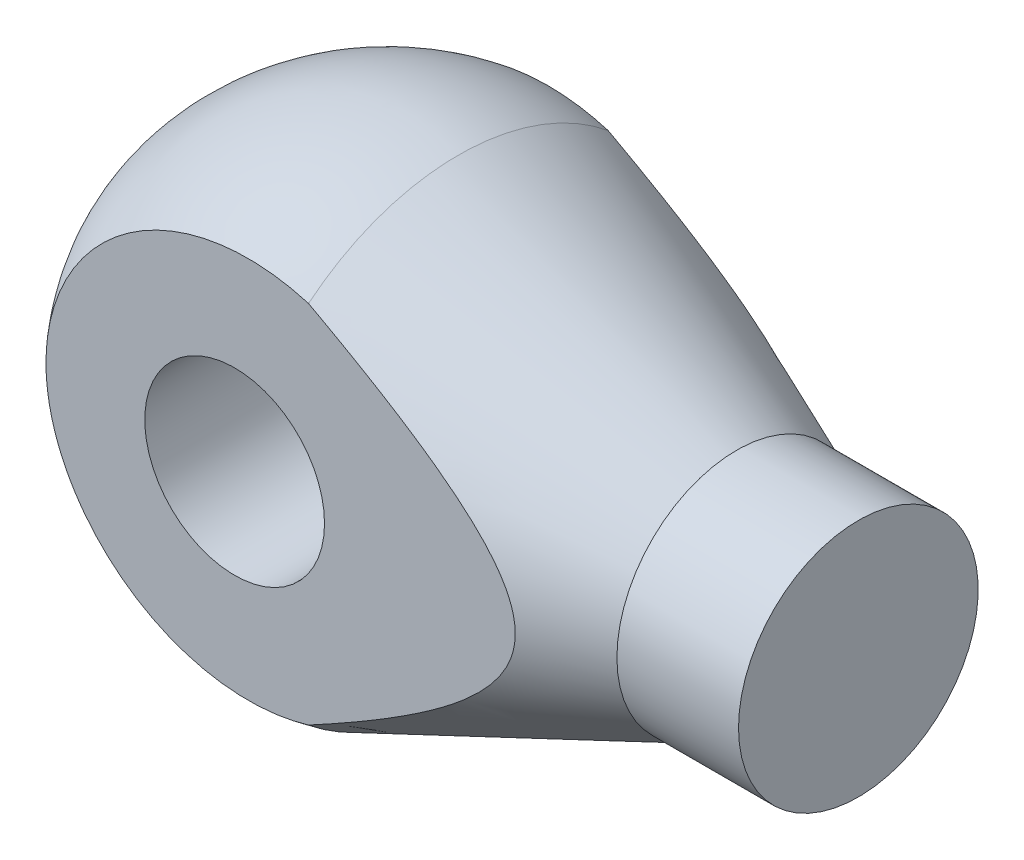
ISO-10303-21;
HEADER;
FILE_DESCRIPTION(('STEP AP214'),'2;1');
FILE_NAME('part.step','',(''),(''),'','','');
FILE_SCHEMA(('AUTOMOTIVE_DESIGN { 1 0 10303 214 1 1 1 1 }'));
ENDSEC;
DATA;
#1=APPLICATION_CONTEXT('core data for automotive mechanical design processes');
#2=APPLICATION_PROTOCOL_DEFINITION('international standard','automotive_design',2000,#1);
#3=PRODUCT_CONTEXT('',#1,'mechanical');
#4=PRODUCT('Part','Part','',(#3));
#5=PRODUCT_RELATED_PRODUCT_CATEGORY('part','',(#4));
#6=PRODUCT_DEFINITION_FORMATION('','',#4);
#7=PRODUCT_DEFINITION_CONTEXT('part definition',#1,'design');
#8=PRODUCT_DEFINITION('design','',#6,#7);
#9=PRODUCT_DEFINITION_SHAPE('','',#8);
#10=(LENGTH_UNIT() NAMED_UNIT(*) SI_UNIT(.MILLI.,.METRE.));
#11=(NAMED_UNIT(*) PLANE_ANGLE_UNIT() SI_UNIT($,.RADIAN.));
#12=(NAMED_UNIT(*) SI_UNIT($,.STERADIAN.) SOLID_ANGLE_UNIT());
#13=UNCERTAINTY_MEASURE_WITH_UNIT(LENGTH_MEASURE(1.E-05),#10,'distance_accuracy_value','');
#14=(GEOMETRIC_REPRESENTATION_CONTEXT(3) GLOBAL_UNCERTAINTY_ASSIGNED_CONTEXT((#13)) GLOBAL_UNIT_ASSIGNED_CONTEXT((#10,
#11,#12)) REPRESENTATION_CONTEXT('',''));
#15=CARTESIAN_POINT('',(0.,0.,0.));
#16=DIRECTION('',(0.,0.,1.));
#17=DIRECTION('',(1.,0.,0.));
#18=AXIS2_PLACEMENT_3D('',#15,#16,#17);
#19=CARTESIAN_POINT('',(35.9985294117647,0.,0.));
#20=DIRECTION('',(-1.,0.,0.));
#21=DIRECTION('',(0.,0.,1.));
#22=AXIS2_PLACEMENT_3D('',#19,#20,#21);
#23=CONICAL_SURFACE('',#22,20.,0.395699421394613);
#24=CARTESIAN_POINT('',(35.9985294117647,0.,0.));
#25=DIRECTION('',(-1.,0.,0.));
#26=DIRECTION('',(0.,0.,1.));
#27=AXIS2_PLACEMENT_3D('',#24,#25,#26);
#28=CIRCLE('',#27,20.);
#29=CARTESIAN_POINT('',(35.9985294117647,0.,20.));
#30=VERTEX_POINT('',#29);
#31=EDGE_CURVE('E40',#30,#30,#28,.T.);
#32=ORIENTED_EDGE('',*,*,#31,.T.);
#33=EDGE_LOOP('',(#32));
#34=FACE_BOUND('',#33,.T.);
#35=CARTESIAN_POINT('',(-49.6909462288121,-49.8810438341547,-25.));
#36=CARTESIAN_POINT('',(-48.7281549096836,-49.431164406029,-25.));
#37=CARTESIAN_POINT('',(-47.7658298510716,-48.9802872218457,-25.));
#38=CARTESIAN_POINT('',(-45.8421994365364,-48.0763615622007,-25.));
#39=CARTESIAN_POINT('',(-44.8808940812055,-47.6233130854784,-25.));
#40=CARTESIAN_POINT('',(-41.9985943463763,-46.2606262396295,-25.));
#41=CARTESIAN_POINT('',(-40.079262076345,-45.3474678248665,-25.));
#42=CARTESIAN_POINT('',(-36.2430812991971,-43.5086917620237,-25.));
#43=CARTESIAN_POINT('',(-34.3262406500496,-42.5830577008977,-25.));
#44=CARTESIAN_POINT('',(-31.4558738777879,-41.184594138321,-25.));
#45=CARTESIAN_POINT('',(-30.4999067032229,-40.7167738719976,-25.));
#46=CARTESIAN_POINT('',(-28.5897788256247,-39.7774416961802,-25.));
#47=CARTESIAN_POINT('',(-27.6356181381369,-39.3059297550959,-25.));
#48=CARTESIAN_POINT('',(-24.6736756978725,-37.8344077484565,-25.));
#49=CARTESIAN_POINT('',(-22.6693437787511,-36.8274235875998,-25.));
#50=CARTESIAN_POINT('',(-19.6714525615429,-35.300086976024,-25.));
#51=CARTESIAN_POINT('',(-18.673593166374,-34.7881664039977,-25.));
#52=CARTESIAN_POINT('',(-16.6811626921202,-33.7579685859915,-25.));
#53=CARTESIAN_POINT('',(-15.6865916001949,-33.2396913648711,-25.));
#54=CARTESIAN_POINT('',(-13.7021572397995,-32.1964264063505,-25.));
#55=CARTESIAN_POINT('',(-12.7122904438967,-31.6714453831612,-25.));
#56=CARTESIAN_POINT('',(-10.7369400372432,-30.6132875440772,-25.));
#57=CARTESIAN_POINT('',(-9.75145643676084,-30.0801107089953,-25.));
#58=CARTESIAN_POINT('',(-7.78568955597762,-29.0043742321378,-25.));
#59=CARTESIAN_POINT('',(-6.80540598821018,-28.4618151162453,-25.));
#60=CARTESIAN_POINT('',(-4.85095508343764,-27.3658030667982,-25.));
#61=CARTESIAN_POINT('',(-3.8767876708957,-26.8123502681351,-25.));
#62=CARTESIAN_POINT('',(-1.94827387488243,-25.6999021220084,-25.));
#63=CARTESIAN_POINT('',(-0.993833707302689,-25.1410696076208,-25.));
#64=CARTESIAN_POINT('',(0.906369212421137,-24.0087522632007,-25.));
#65=CARTESIAN_POINT('',(1.85213173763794,-23.4352670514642,-25.));
#66=CARTESIAN_POINT('',(3.73451979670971,-22.2698154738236,-25.));
#67=CARTESIAN_POINT('',(4.67112637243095,-21.677818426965,-25.));
#68=CARTESIAN_POINT('',(6.53061418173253,-20.4726842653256,-25.));
#69=CARTESIAN_POINT('',(7.45349645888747,-19.8595487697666,-25.));
#70=CARTESIAN_POINT('',(8.81769586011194,-18.9249484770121,-25.));
#71=CARTESIAN_POINT('',(9.26577096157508,-18.613335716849,-25.));
#72=CARTESIAN_POINT('',(10.1569241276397,-17.9830526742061,-25.));
#73=CARTESIAN_POINT('',(10.6000023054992,-17.6643825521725,-25.));
#74=CARTESIAN_POINT('',(11.4805491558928,-17.0190225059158,-25.));
#75=CARTESIAN_POINT('',(11.9180156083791,-16.6923295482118,-25.));
#76=CARTESIAN_POINT('',(12.786177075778,-16.0300618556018,-25.));
#77=CARTESIAN_POINT('',(13.2168721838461,-15.6944872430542,-25.));
#78=CARTESIAN_POINT('',(14.0690517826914,-15.0142705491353,-25.));
#79=CARTESIAN_POINT('',(14.4905590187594,-14.6696570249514,-25.));
#80=CARTESIAN_POINT('',(15.324108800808,-13.969080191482,-25.));
#81=CARTESIAN_POINT('',(15.7361507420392,-13.6131161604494,-25.));
#82=CARTESIAN_POINT('',(16.5484481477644,-12.8885519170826,-25.));
#83=CARTESIAN_POINT('',(16.9487121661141,-12.5199613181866,-25.));
#84=CARTESIAN_POINT('',(17.7351489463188,-11.7680958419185,-25.));
#85=CARTESIAN_POINT('',(18.1213245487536,-11.3848239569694,-25.));
#86=CARTESIAN_POINT('',(18.650085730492,-10.8360799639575,-25.));
#87=CARTESIAN_POINT('',(18.8000209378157,-10.6776647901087,-25.));
#88=CARTESIAN_POINT('',(19.0968037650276,-10.3579672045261,-25.));
#89=CARTESIAN_POINT('',(19.2436513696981,-10.1966847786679,-25.));
#90=CARTESIAN_POINT('',(19.6791646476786,-9.70825956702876,-25.));
#91=CARTESIAN_POINT('',(19.9627738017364,-9.37656668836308,-25.));
#92=CARTESIAN_POINT('',(20.5142131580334,-8.69903445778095,-25.));
#93=CARTESIAN_POINT('',(20.7820069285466,-8.35316533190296,-25.));
#94=CARTESIAN_POINT('',(21.2974743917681,-7.64664538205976,-25.));
#95=CARTESIAN_POINT('',(21.5451479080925,-7.2859944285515,-25.));
#96=CARTESIAN_POINT('',(22.0194457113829,-6.54303002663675,-25.));
#97=CARTESIAN_POINT('',(22.2456814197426,-6.16046643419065,-25.));
#98=CARTESIAN_POINT('',(22.666760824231,-5.37820547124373,-25.));
#99=CARTESIAN_POINT('',(22.8616012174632,-4.97850630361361,-25.));
#100=CARTESIAN_POINT('',(23.2122587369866,-4.16397334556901,-25.));
#101=CARTESIAN_POINT('',(23.3682224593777,-3.74920338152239,-25.));
#102=CARTESIAN_POINT('',(23.634685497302,-2.90532138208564,-25.));
#103=CARTESIAN_POINT('',(23.7452162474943,-2.47621948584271,-25.));
#104=CARTESIAN_POINT('',(23.8878639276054,-1.74441927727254,-25.));
#105=CARTESIAN_POINT('',(23.9337062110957,-1.44435874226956,-25.));
#106=CARTESIAN_POINT('',(23.9996108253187,-0.841420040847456,-25.));
#107=CARTESIAN_POINT('',(24.0196775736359,-0.538542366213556,-25.));
#108=CARTESIAN_POINT('',(24.0333449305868,0.0678307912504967,-25.));
#109=CARTESIAN_POINT('',(24.0269435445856,0.3713263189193,-25.));
#110=CARTESIAN_POINT('',(23.9878946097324,0.976628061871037,-25.));
#111=CARTESIAN_POINT('',(23.9552455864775,1.27843418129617,-25.));
#112=CARTESIAN_POINT('',(23.8649783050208,1.87691470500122,-25.));
#113=CARTESIAN_POINT('',(23.8074690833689,2.17360570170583,-25.));
#114=CARTESIAN_POINT('',(23.6692274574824,2.76153745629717,-25.));
#115=CARTESIAN_POINT('',(23.5884909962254,3.05277725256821,-25.));
#116=CARTESIAN_POINT('',(23.4059280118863,3.62857366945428,-25.));
#117=CARTESIAN_POINT('',(23.3040984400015,3.91312931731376,-25.));
#118=CARTESIAN_POINT('',(23.0816596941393,4.47477110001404,-25.));
#119=CARTESIAN_POINT('',(22.9610484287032,4.75185639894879,-25.));
#120=CARTESIAN_POINT('',(22.6045132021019,5.50765345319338,-25.));
#121=CARTESIAN_POINT('',(22.3510582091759,5.97813623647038,-25.));
#122=CARTESIAN_POINT('',(21.8038178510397,6.89504860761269,-25.));
#123=CARTESIAN_POINT('',(21.5100004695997,7.34145870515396,-25.));
#124=CARTESIAN_POINT('',(20.8898080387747,8.21367940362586,-25.));
#125=CARTESIAN_POINT('',(20.5633040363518,8.63939771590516,-25.));
#126=CARTESIAN_POINT('',(20.0551758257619,9.26267566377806,-25.));
#127=CARTESIAN_POINT('',(19.8827598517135,9.46786098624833,-25.));
#128=CARTESIAN_POINT('',(19.5324332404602,9.87349708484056,-25.));
#129=CARTESIAN_POINT('',(19.3545225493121,10.0739478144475,-25.));
#130=CARTESIAN_POINT('',(18.8869402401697,10.5878889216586,-25.));
#131=CARTESIAN_POINT('',(18.5935194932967,10.8979700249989,-25.));
#132=CARTESIAN_POINT('',(17.9963129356,11.50801989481,-25.));
#133=CARTESIAN_POINT('',(17.6925257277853,11.8079872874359,-25.));
#134=CARTESIAN_POINT('',(17.0760784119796,12.3989419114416,-25.));
#135=CARTESIAN_POINT('',(16.7634141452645,12.6899247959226,-25.));
#136=CARTESIAN_POINT('',(16.130629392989,13.2636814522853,-25.));
#137=CARTESIAN_POINT('',(15.8105084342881,13.5464547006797,-25.));
#138=CARTESIAN_POINT('',(14.8392305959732,14.3848727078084,-25.));
#139=CARTESIAN_POINT('',(14.178453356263,14.9293906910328,-25.));
#140=CARTESIAN_POINT('',(12.8379091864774,15.9939851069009,-25.));
#141=CARTESIAN_POINT('',(12.1581466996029,16.5140671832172,-25.));
#142=CARTESIAN_POINT('',(10.7759308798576,17.5399018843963,-25.));
#143=CARTESIAN_POINT('',(10.0733075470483,18.0454247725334,-25.));
#144=CARTESIAN_POINT('',(8.6559921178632,19.0392712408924,-25.));
#145=CARTESIAN_POINT('',(7.94129940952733,19.5275939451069,-25.));
#146=CARTESIAN_POINT('',(6.50321988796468,20.488982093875,-25.));
#147=CARTESIAN_POINT('',(5.77984695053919,20.9620683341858,-25.));
#148=CARTESIAN_POINT('',(4.6888359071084,21.6623590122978,-25.));
#149=CARTESIAN_POINT('',(4.32417968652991,21.8942290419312,-25.));
#150=CARTESIAN_POINT('',(3.59304561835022,22.3550786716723,-25.));
#151=CARTESIAN_POINT('',(3.22656777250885,22.5840582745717,-25.));
#152=CARTESIAN_POINT('',(1.9395909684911,23.3816668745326,-25.));
#153=CARTESIAN_POINT('',(1.01471390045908,23.9432425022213,-25.));
#154=CARTESIAN_POINT('',(-0.843469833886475,25.0522928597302,-25.));
#155=CARTESIAN_POINT('',(-1.77677678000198,25.5997671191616,-25.));
#156=CARTESIAN_POINT('',(-3.65044306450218,26.6827683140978,-25.));
#157=CARTESIAN_POINT('',(-4.59080326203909,27.2182937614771,-25.));
#158=CARTESIAN_POINT('',(-6.47731362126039,28.2790134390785,-25.));
#159=CARTESIAN_POINT('',(-7.42346373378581,28.8042077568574,-25.));
#160=CARTESIAN_POINT('',(-9.32108170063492,29.8458688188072,-25.));
#161=CARTESIAN_POINT('',(-10.272551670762,30.3623317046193,-25.));
#162=CARTESIAN_POINT('',(-12.1797014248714,31.3874336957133,-25.));
#163=CARTESIAN_POINT('',(-13.1353812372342,31.896072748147,-25.));
#164=CARTESIAN_POINT('',(-15.0503881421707,32.9064740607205,-25.));
#165=CARTESIAN_POINT('',(-16.0097152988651,33.4082361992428,-25.));
#166=CARTESIAN_POINT('',(-17.9315331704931,34.4056660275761,-25.));
#167=CARTESIAN_POINT('',(-18.8940238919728,34.9013337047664,-25.));
#168=CARTESIAN_POINT('',(-20.8240993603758,35.8884296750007,-25.));
#169=CARTESIAN_POINT('',(-21.7916907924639,36.3798448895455,-25.));
#170=CARTESIAN_POINT('',(-23.7293195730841,37.3577906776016,-25.));
#171=CARTESIAN_POINT('',(-24.6993568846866,37.8443213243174,-25.));
#172=CARTESIAN_POINT('',(-26.6416335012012,38.8130087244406,-25.));
#173=CARTESIAN_POINT('',(-27.6138728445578,39.2951654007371,-25.));
#174=CARTESIAN_POINT('',(-29.5603072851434,40.255522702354,-25.));
#175=CARTESIAN_POINT('',(-30.5345023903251,40.7337233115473,-25.));
#176=CARTESIAN_POINT('',(-33.4591724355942,42.1626972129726,-25.));
#177=CARTESIAN_POINT('',(-35.4122680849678,43.1081093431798,-25.));
#178=CARTESIAN_POINT('',(-39.3241350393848,44.9870768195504,-25.));
#179=CARTESIAN_POINT('',(-41.2829063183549,45.9206322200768,-25.));
#180=CARTESIAN_POINT('',(-44.9916959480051,47.6766990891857,-25.));
#181=CARTESIAN_POINT('',(-46.7412288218,48.5002365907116,-25.));
#182=CARTESIAN_POINT('',(-50.2434988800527,50.1404685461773,-25.));
#183=CARTESIAN_POINT('',(-51.9962360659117,50.9571629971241,-25.));
#184=CARTESIAN_POINT('',(-55.5046130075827,52.5846586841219,-25.));
#185=CARTESIAN_POINT('',(-57.260252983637,53.395459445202,-25.));
#186=CARTESIAN_POINT('',(-60.7739361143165,55.0118373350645,-25.));
#187=CARTESIAN_POINT('',(-62.5319792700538,55.8174144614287,-25.));
#188=CARTESIAN_POINT('',(-66.0426807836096,57.4205421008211,-25.));
#189=CARTESIAN_POINT('',(-67.7953302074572,58.2181121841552,-25.));
#190=CARTESIAN_POINT('',(-71.3024685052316,59.809198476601,-25.));
#191=CARTESIAN_POINT('',(-73.0569573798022,60.6027146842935,-25.));
#192=CARTESIAN_POINT('',(-76.5673892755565,62.186055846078,-25.));
#193=CARTESIAN_POINT('',(-78.3233321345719,62.9758811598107,-25.));
#194=CARTESIAN_POINT('',(-81.8366720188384,64.5522845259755,-25.));
#195=CARTESIAN_POINT('',(-83.5940690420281,65.3388625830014,-25.));
#196=CARTESIAN_POINT('',(-85.3521084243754,66.1240003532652,-25.));
#197=B_SPLINE_CURVE_WITH_KNOTS('',3,(#35,#36,#37,#38,#39,#40,#41,#42,#43,#44,#45,#46,#47,#48,
#49,#50,#51,#52,#53,#54,#55,#56,#57,#58,#59,#60,#61,#62,#63,#64,#65,#66,#67,#68,#69,#70,#71,#72,
#73,#74,#75,#76,#77,#78,#79,#80,#81,#82,#83,#84,#85,#86,#87,#88,#89,#90,#91,#92,#93,#94,#95,#96,
#97,#98,#99,#100,#101,#102,#103,#104,#105,#106,#107,#108,#109,#110,#111,#112,#113,#114,#115,
#116,#117,#118,#119,#120,#121,#122,#123,#124,#125,#126,#127,#128,#129,#130,#131,#132,#133,#134,
#135,#136,#137,#138,#139,#140,#141,#142,#143,#144,#145,#146,#147,#148,#149,#150,#151,#152,#153,
#154,#155,#156,#157,#158,#159,#160,#161,#162,#163,#164,#165,#166,#167,#168,#169,#170,#171,#172,
#173,#174,#175,#176,#177,#178,#179,#180,#181,#182,#183,#184,#185,#186,#187,#188,#189,#190,#191,
#192,#193,#194,#195,#196),.UNSPECIFIED.,.F.,.F.,(4,2,2,2,2,2,2,2,2,2,2,2,2,2,2,2,2,2,2,2,2,2,2,
2,2,2,2,2,2,2,2,2,2,2,2,2,2,2,2,2,2,2,2,2,2,2,2,2,2,2,2,2,2,2,2,2,2,2,2,2,2,2,2,2,2,2,2,2,2,2,2,
2,2,2,2,2,2,2,2,2,4),(0.,3.18813768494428,6.37627722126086,12.7527078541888,19.1385583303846,
22.3314430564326,25.5243551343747,32.2534276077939,35.6179419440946,38.9824431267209,
42.3438042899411,45.7051733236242,49.0663545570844,52.4274941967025,55.7454051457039,
59.0634026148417,62.3872257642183,65.7107948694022,67.3480745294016,68.9853170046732,
70.6231883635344,72.2610371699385,73.8942197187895,75.5275063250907,77.1595758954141,
78.7913145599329,79.4456372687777,80.099963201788,81.4087312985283,82.7204052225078,
84.0320906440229,85.3642354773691,86.6965203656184,88.0237027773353,89.349965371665,
90.2595890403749,91.1690567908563,92.0785930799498,92.9881804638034,93.8938182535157,
94.799614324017,95.7055414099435,96.6115694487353,98.2119943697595,99.8136961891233,
101.421986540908,102.225935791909,103.029892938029,104.31029660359,105.590873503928,
106.872060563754,108.153329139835,110.721207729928,113.288490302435,115.88492127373,
118.481484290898,121.074338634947,122.370723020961,123.667106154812,126.912991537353,
130.158985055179,133.405380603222,136.651748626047,139.89951555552,143.147304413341,
146.395150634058,149.643003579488,152.898675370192,156.154298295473,159.409978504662,
162.665671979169,169.175262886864,175.684823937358,181.485816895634,187.286812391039,
193.08827031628,198.889730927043,204.666496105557,210.443263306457,216.219455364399,
221.995639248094),.UNSPECIFIED.);
#198=CARTESIAN_POINT('',(-10.4660426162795,30.4652489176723,-25.));
#199=VERTEX_POINT('',#198);
#200=CARTESIAN_POINT('',(-10.4660426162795,-30.4652489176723,-25.));
#201=VERTEX_POINT('',#200);
#202=EDGE_CURVE('E47',#199,#201,#197,.F.);
#203=ORIENTED_EDGE('',*,*,#202,.F.);
#204=CARTESIAN_POINT('',(-10.4660426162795,0.,0.));
#205=DIRECTION('',(-1.,0.,0.));
#206=DIRECTION('',(0.,0.,1.));
#207=AXIS2_PLACEMENT_3D('',#204,#205,#206);
#208=CIRCLE('',#207,39.409788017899);
#209=CARTESIAN_POINT('',(-10.4660426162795,30.4652489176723,25.));
#210=VERTEX_POINT('',#209);
#211=EDGE_CURVE('E71',#210,#199,#208,.T.);
#212=ORIENTED_EDGE('',*,*,#211,.F.);
#213=CARTESIAN_POINT('',(-49.690946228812,-49.8810438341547,25.));
#214=CARTESIAN_POINT('',(-48.7281549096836,-49.431164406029,25.));
#215=CARTESIAN_POINT('',(-47.7658298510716,-48.9802872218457,25.));
#216=CARTESIAN_POINT('',(-45.8421994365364,-48.0763615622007,25.));
#217=CARTESIAN_POINT('',(-44.8808940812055,-47.6233130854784,25.));
#218=CARTESIAN_POINT('',(-41.9985943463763,-46.2606262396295,25.));
#219=CARTESIAN_POINT('',(-40.079262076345,-45.3474678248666,25.));
#220=CARTESIAN_POINT('',(-36.2430812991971,-43.5086917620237,25.));
#221=CARTESIAN_POINT('',(-34.3262406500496,-42.5830577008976,25.));
#222=CARTESIAN_POINT('',(-31.4558738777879,-41.184594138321,25.));
#223=CARTESIAN_POINT('',(-30.4999067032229,-40.7167738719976,25.));
#224=CARTESIAN_POINT('',(-28.5897788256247,-39.7774416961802,25.));
#225=CARTESIAN_POINT('',(-27.6356181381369,-39.3059297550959,25.));
#226=CARTESIAN_POINT('',(-24.6736756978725,-37.8344077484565,25.));
#227=CARTESIAN_POINT('',(-22.6693437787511,-36.8274235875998,25.));
#228=CARTESIAN_POINT('',(-19.6714525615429,-35.300086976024,25.));
#229=CARTESIAN_POINT('',(-18.673593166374,-34.7881664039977,25.));
#230=CARTESIAN_POINT('',(-16.6811626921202,-33.7579685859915,25.));
#231=CARTESIAN_POINT('',(-15.6865916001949,-33.2396913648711,25.));
#232=CARTESIAN_POINT('',(-13.7021572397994,-32.1964264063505,25.));
#233=CARTESIAN_POINT('',(-12.7122904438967,-31.6714453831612,25.));
#234=CARTESIAN_POINT('',(-10.7369400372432,-30.6132875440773,25.));
#235=CARTESIAN_POINT('',(-9.75145643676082,-30.0801107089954,25.));
#236=CARTESIAN_POINT('',(-7.7856895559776,-29.0043742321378,25.));
#237=CARTESIAN_POINT('',(-6.80540598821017,-28.4618151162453,25.));
#238=CARTESIAN_POINT('',(-4.85095508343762,-27.3658030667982,25.));
#239=CARTESIAN_POINT('',(-3.87678767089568,-26.8123502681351,25.));
#240=CARTESIAN_POINT('',(-1.94827387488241,-25.6999021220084,25.));
#241=CARTESIAN_POINT('',(-0.993833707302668,-25.1410696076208,25.));
#242=CARTESIAN_POINT('',(0.906369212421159,-24.0087522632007,25.));
#243=CARTESIAN_POINT('',(1.85213173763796,-23.4352670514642,25.));
#244=CARTESIAN_POINT('',(3.73451979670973,-22.2698154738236,25.));
#245=CARTESIAN_POINT('',(4.67112637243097,-21.677818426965,25.));
#246=CARTESIAN_POINT('',(6.53061418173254,-20.4726842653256,25.));
#247=CARTESIAN_POINT('',(7.45349645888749,-19.8595487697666,25.));
#248=CARTESIAN_POINT('',(8.81769586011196,-18.9249484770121,25.));
#249=CARTESIAN_POINT('',(9.26577096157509,-18.613335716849,25.));
#250=CARTESIAN_POINT('',(10.1569241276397,-17.9830526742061,25.));
#251=CARTESIAN_POINT('',(10.6000023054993,-17.6643825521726,25.));
#252=CARTESIAN_POINT('',(11.4805491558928,-17.0190225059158,25.));
#253=CARTESIAN_POINT('',(11.9180156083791,-16.6923295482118,25.));
#254=CARTESIAN_POINT('',(12.786177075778,-16.0300618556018,25.));
#255=CARTESIAN_POINT('',(13.2168721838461,-15.6944872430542,25.));
#256=CARTESIAN_POINT('',(14.0690517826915,-15.0142705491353,25.));
#257=CARTESIAN_POINT('',(14.4905590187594,-14.6696570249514,25.));
#258=CARTESIAN_POINT('',(15.324108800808,-13.969080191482,25.));
#259=CARTESIAN_POINT('',(15.7361507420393,-13.6131161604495,25.));
#260=CARTESIAN_POINT('',(16.5484481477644,-12.8885519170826,25.));
#261=CARTESIAN_POINT('',(16.9487121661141,-12.5199613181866,25.));
#262=CARTESIAN_POINT('',(17.7351489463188,-11.7680958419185,25.));
#263=CARTESIAN_POINT('',(18.1213245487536,-11.3848239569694,25.));
#264=CARTESIAN_POINT('',(18.650085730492,-10.8360799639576,25.));
#265=CARTESIAN_POINT('',(18.8000209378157,-10.6776647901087,25.));
#266=CARTESIAN_POINT('',(19.0968037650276,-10.3579672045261,25.));
#267=CARTESIAN_POINT('',(19.2436513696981,-10.1966847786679,25.));
#268=CARTESIAN_POINT('',(19.6791646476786,-9.70825956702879,25.));
#269=CARTESIAN_POINT('',(19.9627738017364,-9.37656668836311,25.));
#270=CARTESIAN_POINT('',(20.5142131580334,-8.69903445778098,25.));
#271=CARTESIAN_POINT('',(20.7820069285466,-8.35316533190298,25.));
#272=CARTESIAN_POINT('',(21.2974743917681,-7.64664538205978,25.));
#273=CARTESIAN_POINT('',(21.5451479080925,-7.28599442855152,25.));
#274=CARTESIAN_POINT('',(22.0194457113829,-6.54303002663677,25.));
#275=CARTESIAN_POINT('',(22.2456814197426,-6.16046643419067,25.));
#276=CARTESIAN_POINT('',(22.666760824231,-5.37820547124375,25.));
#277=CARTESIAN_POINT('',(22.8616012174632,-4.97850630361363,25.));
#278=CARTESIAN_POINT('',(23.2122587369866,-4.16397334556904,25.));
#279=CARTESIAN_POINT('',(23.3682224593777,-3.74920338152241,25.));
#280=CARTESIAN_POINT('',(23.634685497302,-2.90532138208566,25.));
#281=CARTESIAN_POINT('',(23.7452162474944,-2.47621948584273,25.));
#282=CARTESIAN_POINT('',(23.8878639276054,-1.74441927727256,25.));
#283=CARTESIAN_POINT('',(23.9337062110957,-1.44435874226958,25.));
#284=CARTESIAN_POINT('',(23.9996108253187,-0.84142004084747,25.));
#285=CARTESIAN_POINT('',(24.019677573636,-0.538542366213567,25.));
#286=CARTESIAN_POINT('',(24.0333449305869,0.0678307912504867,25.));
#287=CARTESIAN_POINT('',(24.0269435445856,0.371326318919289,25.));
#288=CARTESIAN_POINT('',(23.9878946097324,0.976628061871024,25.));
#289=CARTESIAN_POINT('',(23.9552455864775,1.27843418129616,25.));
#290=CARTESIAN_POINT('',(23.8649783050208,1.8769147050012,25.));
#291=CARTESIAN_POINT('',(23.8074690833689,2.17360570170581,25.));
#292=CARTESIAN_POINT('',(23.6692274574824,2.76153745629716,25.));
#293=CARTESIAN_POINT('',(23.5884909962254,3.0527772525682,25.));
#294=CARTESIAN_POINT('',(23.4059280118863,3.62857366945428,25.));
#295=CARTESIAN_POINT('',(23.3040984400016,3.91312931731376,25.));
#296=CARTESIAN_POINT('',(23.0816596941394,4.47477110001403,25.));
#297=CARTESIAN_POINT('',(22.9610484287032,4.75185639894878,25.));
#298=CARTESIAN_POINT('',(22.6045132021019,5.50765345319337,25.));
#299=CARTESIAN_POINT('',(22.3510582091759,5.97813623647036,25.));
#300=CARTESIAN_POINT('',(21.8038178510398,6.89504860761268,25.));
#301=CARTESIAN_POINT('',(21.5100004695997,7.34145870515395,25.));
#302=CARTESIAN_POINT('',(20.8898080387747,8.21367940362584,25.));
#303=CARTESIAN_POINT('',(20.5633040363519,8.63939771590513,25.));
#304=CARTESIAN_POINT('',(20.0551758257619,9.26267566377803,25.));
#305=CARTESIAN_POINT('',(19.8827598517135,9.46786098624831,25.));
#306=CARTESIAN_POINT('',(19.5324332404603,9.87349708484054,25.));
#307=CARTESIAN_POINT('',(19.3545225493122,10.0739478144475,25.));
#308=CARTESIAN_POINT('',(18.8869402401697,10.5878889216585,25.));
#309=CARTESIAN_POINT('',(18.5935194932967,10.8979700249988,25.));
#310=CARTESIAN_POINT('',(17.9963129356,11.50801989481,25.));
#311=CARTESIAN_POINT('',(17.6925257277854,11.8079872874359,25.));
#312=CARTESIAN_POINT('',(17.0760784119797,12.3989419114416,25.));
#313=CARTESIAN_POINT('',(16.7634141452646,12.6899247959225,25.));
#314=CARTESIAN_POINT('',(16.130629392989,13.2636814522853,25.));
#315=CARTESIAN_POINT('',(15.8105084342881,13.5464547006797,25.));
#316=CARTESIAN_POINT('',(14.8392305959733,14.3848727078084,25.));
#317=CARTESIAN_POINT('',(14.178453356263,14.9293906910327,25.));
#318=CARTESIAN_POINT('',(12.8379091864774,15.9939851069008,25.));
#319=CARTESIAN_POINT('',(12.158146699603,16.5140671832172,25.));
#320=CARTESIAN_POINT('',(10.7759308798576,17.5399018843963,25.));
#321=CARTESIAN_POINT('',(10.0733075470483,18.0454247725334,25.));
#322=CARTESIAN_POINT('',(8.65599211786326,19.0392712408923,25.));
#323=CARTESIAN_POINT('',(7.94129940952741,19.5275939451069,25.));
#324=CARTESIAN_POINT('',(6.50321988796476,20.488982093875,25.));
#325=CARTESIAN_POINT('',(5.77984695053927,20.9620683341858,25.));
#326=CARTESIAN_POINT('',(4.68883590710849,21.6623590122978,25.));
#327=CARTESIAN_POINT('',(4.32417968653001,21.8942290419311,25.));
#328=CARTESIAN_POINT('',(3.59304561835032,22.3550786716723,25.));
#329=CARTESIAN_POINT('',(3.22656777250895,22.5840582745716,25.));
#330=CARTESIAN_POINT('',(1.9395909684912,23.3816668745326,25.));
#331=CARTESIAN_POINT('',(1.01471390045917,23.9432425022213,25.));
#332=CARTESIAN_POINT('',(-0.843469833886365,25.0522928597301,25.));
#333=CARTESIAN_POINT('',(-1.77677678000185,25.5997671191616,25.));
#334=CARTESIAN_POINT('',(-3.65044306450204,26.6827683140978,25.));
#335=CARTESIAN_POINT('',(-4.59080326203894,27.218293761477,25.));
#336=CARTESIAN_POINT('',(-6.47731362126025,28.2790134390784,25.));
#337=CARTESIAN_POINT('',(-7.42346373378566,28.8042077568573,25.));
#338=CARTESIAN_POINT('',(-9.32108170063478,29.8458688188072,25.));
#339=CARTESIAN_POINT('',(-10.2725516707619,30.3623317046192,25.));
#340=CARTESIAN_POINT('',(-12.1797014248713,31.3874336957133,25.));
#341=CARTESIAN_POINT('',(-13.1353812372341,31.896072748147,25.));
#342=CARTESIAN_POINT('',(-15.0503881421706,32.9064740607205,25.));
#343=CARTESIAN_POINT('',(-16.009715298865,33.4082361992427,25.));
#344=CARTESIAN_POINT('',(-17.9315331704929,34.4056660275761,25.));
#345=CARTESIAN_POINT('',(-18.8940238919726,34.9013337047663,25.));
#346=CARTESIAN_POINT('',(-20.8240993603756,35.8884296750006,25.));
#347=CARTESIAN_POINT('',(-21.7916907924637,36.3798448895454,25.));
#348=CARTESIAN_POINT('',(-23.7293195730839,37.3577906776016,25.));
#349=CARTESIAN_POINT('',(-24.6993568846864,37.8443213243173,25.));
#350=CARTESIAN_POINT('',(-26.641633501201,38.8130087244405,25.));
#351=CARTESIAN_POINT('',(-27.6138728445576,39.295165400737,25.));
#352=CARTESIAN_POINT('',(-29.5603072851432,40.2555227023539,25.));
#353=CARTESIAN_POINT('',(-30.5345023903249,40.7337233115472,25.));
#354=CARTESIAN_POINT('',(-33.459172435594,42.1626972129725,25.));
#355=CARTESIAN_POINT('',(-35.4122680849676,43.1081093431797,25.));
#356=CARTESIAN_POINT('',(-39.3241350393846,44.9870768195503,25.));
#357=CARTESIAN_POINT('',(-41.2829063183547,45.9206322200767,25.));
#358=CARTESIAN_POINT('',(-44.9916959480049,47.6766990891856,25.));
#359=CARTESIAN_POINT('',(-46.7412288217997,48.5002365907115,25.));
#360=CARTESIAN_POINT('',(-50.2434988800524,50.1404685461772,25.));
#361=CARTESIAN_POINT('',(-51.9962360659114,50.957162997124,25.));
#362=CARTESIAN_POINT('',(-55.5046130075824,52.5846586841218,25.));
#363=CARTESIAN_POINT('',(-57.2602529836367,53.3954594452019,25.));
#364=CARTESIAN_POINT('',(-60.7739361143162,55.0118373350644,25.));
#365=CARTESIAN_POINT('',(-62.5319792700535,55.8174144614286,25.));
#366=CARTESIAN_POINT('',(-66.0426807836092,57.420542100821,25.));
#367=CARTESIAN_POINT('',(-67.7953302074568,58.218112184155,25.));
#368=CARTESIAN_POINT('',(-71.3024685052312,59.8091984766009,25.));
#369=CARTESIAN_POINT('',(-73.0569573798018,60.6027146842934,25.));
#370=CARTESIAN_POINT('',(-76.567389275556,62.1860558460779,25.));
#371=CARTESIAN_POINT('',(-78.3233321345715,62.9758811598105,25.));
#372=CARTESIAN_POINT('',(-81.836672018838,64.5522845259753,25.));
#373=CARTESIAN_POINT('',(-83.5940690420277,65.3388625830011,25.));
#374=CARTESIAN_POINT('',(-85.352108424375,66.124000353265,25.));
#375=B_SPLINE_CURVE_WITH_KNOTS('',3,(#213,#214,#215,#216,#217,#218,#219,#220,#221,#222,#223,
#224,#225,#226,#227,#228,#229,#230,#231,#232,#233,#234,#235,#236,#237,#238,#239,#240,#241,#242,
#243,#244,#245,#246,#247,#248,#249,#250,#251,#252,#253,#254,#255,#256,#257,#258,#259,#260,#261,
#262,#263,#264,#265,#266,#267,#268,#269,#270,#271,#272,#273,#274,#275,#276,#277,#278,#279,#280,
#281,#282,#283,#284,#285,#286,#287,#288,#289,#290,#291,#292,#293,#294,#295,#296,#297,#298,#299,
#300,#301,#302,#303,#304,#305,#306,#307,#308,#309,#310,#311,#312,#313,#314,#315,#316,#317,#318,
#319,#320,#321,#322,#323,#324,#325,#326,#327,#328,#329,#330,#331,#332,#333,#334,#335,#336,#337,
#338,#339,#340,#341,#342,#343,#344,#345,#346,#347,#348,#349,#350,#351,#352,#353,#354,#355,#356,
#357,#358,#359,#360,#361,#362,#363,#364,#365,#366,#367,#368,#369,#370,#371,#372,#373,#374),
.UNSPECIFIED.,.F.,.F.,(4,2,2,2,2,2,2,2,2,2,2,2,2,2,2,2,2,2,2,2,2,2,2,2,2,2,2,2,2,2,2,2,2,2,2,2,
2,2,2,2,2,2,2,2,2,2,2,2,2,2,2,2,2,2,2,2,2,2,2,2,2,2,2,2,2,2,2,2,2,2,2,2,2,2,2,2,2,2,2,2,4),(0.,
3.18813768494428,6.37627722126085,12.7527078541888,19.1385583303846,22.3314430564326,
25.5243551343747,32.2534276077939,35.6179419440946,38.9824431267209,42.3438042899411,
45.7051733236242,49.0663545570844,52.4274941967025,55.7454051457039,59.0634026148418,
62.3872257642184,65.7107948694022,67.3480745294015,68.9853170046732,70.6231883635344,
72.2610371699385,73.8942197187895,75.5275063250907,77.1595758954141,78.7913145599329,
79.4456372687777,80.0999632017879,81.4087312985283,82.7204052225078,84.0320906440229,
85.3642354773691,86.6965203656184,88.0237027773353,89.349965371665,90.2595890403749,
91.1690567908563,92.0785930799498,92.9881804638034,93.8938182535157,94.799614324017,
95.7055414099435,96.6115694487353,98.2119943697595,99.8136961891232,101.421986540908,
102.225935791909,103.029892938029,104.31029660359,105.590873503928,106.872060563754,
108.153329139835,110.721207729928,113.288490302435,115.88492127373,118.481484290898,
121.074338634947,122.370723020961,123.667106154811,126.912991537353,130.158985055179,
133.405380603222,136.651748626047,139.89951555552,143.14730441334,146.395150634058,
149.643003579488,152.898675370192,156.154298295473,159.409978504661,162.665671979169,
169.175262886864,175.684823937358,181.485816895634,187.286812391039,193.088270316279,
198.889730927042,204.666496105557,210.443263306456,216.219455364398,221.995639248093),.UNSPECIFIED.);
#376=CARTESIAN_POINT('',(-10.4660426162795,-30.4652489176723,25.));
#377=VERTEX_POINT('',#376);
#378=EDGE_CURVE('E54',#377,#210,#375,.T.);
#379=ORIENTED_EDGE('',*,*,#378,.F.);
#380=EDGE_CURVE('E72',#201,#377,#208,.T.);
#381=ORIENTED_EDGE('',*,*,#380,.F.);
#382=EDGE_LOOP('',(#203,#212,#379,#381));
#383=FACE_BOUND('',#382,.T.);
#384=ADVANCED_FACE('F31',(#34,#383),#23,.T.);
#385=CARTESIAN_POINT('',(-20.5029703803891,0.,-3.89220478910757));
#386=DIRECTION('',(0.,-1.,0.));
#387=DIRECTION('',(0.,0.,1.));
#388=AXIS2_PLACEMENT_3D('',#385,#386,#387);
#389=CIRCLE('',#388,44.45);
#390=TRIMMED_CURVE('',#389,(PARAMETER_VALUE(-1.48312037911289)),
(PARAMETER_VALUE(1.48312037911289)),.T.,.PARAMETER.);
#391=CARTESIAN_POINT('',(-20.5029703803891,0.,0.));
#392=DIRECTION('',(-1.,0.,0.));
#393=AXIS1_PLACEMENT('',#391,#392);
#394=SURFACE_OF_REVOLUTION('',#390,#393);
#395=CARTESIAN_POINT('',(-64.7822346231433,0.,0.));
#396=VERTEX_POINT('',#395);
#397=VERTEX_LOOP('',#396);
#398=FACE_BOUND('',#397,.T.);
#399=CARTESIAN_POINT('',(-54.2822984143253,0.,-25.));
#400=CARTESIAN_POINT('',(-54.282290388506,0.828357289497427,-25.));
#401=CARTESIAN_POINT('',(-54.2470331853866,1.65686000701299,-25.));
#402=CARTESIAN_POINT('',(-54.1064674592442,3.30800680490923,-25.));
#403=CARTESIAN_POINT('',(-54.001142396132,4.13064945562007,-25.));
#404=CARTESIAN_POINT('',(-53.7217153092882,5.76508638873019,-25.));
#405=CARTESIAN_POINT('',(-53.5475387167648,6.57686791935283,-25.));
#406=CARTESIAN_POINT('',(-53.1326276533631,8.18316237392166,-25.));
#407=CARTESIAN_POINT('',(-52.8918960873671,8.97767604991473,-25.));
#408=CARTESIAN_POINT('',(-52.3454162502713,10.5479946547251,-25.));
#409=CARTESIAN_POINT('',(-52.039380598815,11.3236994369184,-25.));
#410=CARTESIAN_POINT('',(-51.3661236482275,12.8480566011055,-25.));
#411=CARTESIAN_POINT('',(-50.9989016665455,13.5967086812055,-25.));
#412=CARTESIAN_POINT('',(-50.2067042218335,15.0627149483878,-25.));
#413=CARTESIAN_POINT('',(-49.7817323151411,15.780071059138,-25.));
#414=CARTESIAN_POINT('',(-48.8775303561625,17.1797654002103,-25.));
#415=CARTESIAN_POINT('',(-48.3982960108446,17.86210085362,-25.));
#416=CARTESIAN_POINT('',(-47.3556175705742,19.2323664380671,-25.));
#417=CARTESIAN_POINT('',(-46.7886924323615,19.9176495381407,-25.));
#418=CARTESIAN_POINT('',(-45.6017088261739,21.2405420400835,-25.));
#419=CARTESIAN_POINT('',(-44.9816483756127,21.8781496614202,-25.));
#420=CARTESIAN_POINT('',(-43.6928284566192,23.1023117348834,-25.));
#421=CARTESIAN_POINT('',(-43.0240585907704,23.6888552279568,-25.));
#422=CARTESIAN_POINT('',(-41.6424407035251,24.807661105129,-25.));
#423=CARTESIAN_POINT('',(-40.9295916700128,25.3399222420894,-25.));
#424=CARTESIAN_POINT('',(-39.8091803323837,26.1103519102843,-25.));
#425=CARTESIAN_POINT('',(-39.4156436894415,26.369143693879,-25.));
#426=CARTESIAN_POINT('',(-38.6183468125,26.8702538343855,-25.));
#427=CARTESIAN_POINT('',(-38.2145889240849,27.1125759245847,-25.));
#428=CARTESIAN_POINT('',(-36.9888141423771,27.814425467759,-25.));
#429=CARTESIAN_POINT('',(-36.1522494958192,28.2488682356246,-25.));
#430=CARTESIAN_POINT('',(-34.4464622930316,29.0480774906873,-25.));
#431=CARTESIAN_POINT('',(-33.5772350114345,29.4128338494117,-25.));
#432=CARTESIAN_POINT('',(-31.8120000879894,30.0705442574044,-25.));
#433=CARTESIAN_POINT('',(-30.9159921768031,30.363497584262,-25.));
#434=CARTESIAN_POINT('',(-29.0748085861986,30.8838965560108,-25.));
#435=CARTESIAN_POINT('',(-28.1289717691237,31.1090047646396,-25.));
#436=CARTESIAN_POINT('',(-26.2218178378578,31.479625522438,-25.));
#437=CARTESIAN_POINT('',(-25.2605003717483,31.6251362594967,-25.));
#438=CARTESIAN_POINT('',(-23.3290255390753,31.8356649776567,-25.));
#439=CARTESIAN_POINT('',(-22.3588675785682,31.9006775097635,-25.));
#440=CARTESIAN_POINT('',(-20.4165077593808,31.9497907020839,-25.));
#441=CARTESIAN_POINT('',(-19.4443058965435,31.933891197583,-25.));
#442=CARTESIAN_POINT('',(-17.4932253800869,31.8206167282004,-25.));
#443=CARTESIAN_POINT('',(-16.5144018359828,31.7222899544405,-25.));
#444=CARTESIAN_POINT('',(-14.5685052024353,31.4435357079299,-25.));
#445=CARTESIAN_POINT('',(-13.6014322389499,31.2631073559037,-25.));
#446=CARTESIAN_POINT('',(-11.6859291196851,30.821284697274,-25.));
#447=CARTESIAN_POINT('',(-10.7374994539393,30.5598882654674,-25.));
#448=CARTESIAN_POINT('',(-8.86615402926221,29.9577866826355,-25.));
#449=CARTESIAN_POINT('',(-7.94323815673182,29.6170818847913,-25.));
#450=CARTESIAN_POINT('',(-6.13125838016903,28.8591917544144,-25.));
#451=CARTESIAN_POINT('',(-5.24213785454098,28.4421418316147,-25.));
#452=CARTESIAN_POINT('',(-3.50263974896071,27.5338083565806,-25.));
#453=CARTESIAN_POINT('',(-2.65226233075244,27.0425244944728,-25.));
#454=CARTESIAN_POINT('',(-0.996706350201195,25.9888371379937,-25.));
#455=CARTESIAN_POINT('',(-0.191529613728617,25.4264307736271,-25.));
#456=CARTESIAN_POINT('',(1.3672194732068,24.2341337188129,-25.));
#457=CARTESIAN_POINT('',(2.12079262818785,23.6042440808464,-25.));
#458=CARTESIAN_POINT('',(3.55780538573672,22.2923068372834,-25.));
#459=CARTESIAN_POINT('',(4.24221747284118,21.6113246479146,-25.));
#460=CARTESIAN_POINT('',(5.54933507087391,20.1924623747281,-25.));
#461=CARTESIAN_POINT('',(6.17204062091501,19.4545823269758,-25.));
#462=CARTESIAN_POINT('',(7.34998504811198,17.9268216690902,-25.));
#463=CARTESIAN_POINT('',(7.90522739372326,17.1369437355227,-25.));
#464=CARTESIAN_POINT('',(8.94265077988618,15.5105586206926,-25.));
#465=CARTESIAN_POINT('',(9.42483495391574,14.6740534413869,-25.));
#466=CARTESIAN_POINT('',(10.291671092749,12.9972123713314,-25.));
#467=CARTESIAN_POINT('',(10.6796204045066,12.1585811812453,-25.));
#468=CARTESIAN_POINT('',(11.379043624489,10.4499688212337,-25.));
#469=CARTESIAN_POINT('',(11.6905194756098,9.57998844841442,-25.));
#470=CARTESIAN_POINT('',(12.2326602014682,7.81579944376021,-25.));
#471=CARTESIAN_POINT('',(12.4633791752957,6.92160746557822,-25.));
#472=CARTESIAN_POINT('',(12.8408229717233,5.11567099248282,-25.));
#473=CARTESIAN_POINT('',(12.9875541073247,4.2039278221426,-25.));
#474=CARTESIAN_POINT('',(13.1871208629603,2.43725787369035,-25.));
#475=CARTESIAN_POINT('',(13.2459974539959,1.58300924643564,-25.));
#476=CARTESIAN_POINT('',(13.288591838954,-0.127337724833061,-25.));
#477=CARTESIAN_POINT('',(13.2723136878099,-0.983435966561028,-25.));
#478=CARTESIAN_POINT('',(13.1648534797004,-2.69082713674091,-25.));
#479=CARTESIAN_POINT('',(13.0736777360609,-3.54212046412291,-25.));
#480=CARTESIAN_POINT('',(12.8177683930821,-5.23356317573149,-25.));
#481=CARTESIAN_POINT('',(12.6530346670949,-6.07371254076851,-25.));
#482=CARTESIAN_POINT('',(12.2592734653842,-7.70776084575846,-25.));
#483=CARTESIAN_POINT('',(12.0326892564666,-8.50225081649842,-25.));
#484=CARTESIAN_POINT('',(11.5157670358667,-10.0701554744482,-25.));
#485=CARTESIAN_POINT('',(11.2254310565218,-10.8435708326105,-25.));
#486=CARTESIAN_POINT('',(10.5839742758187,-12.3648943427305,-25.));
#487=CARTESIAN_POINT('',(10.2328433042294,-13.1127982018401,-25.));
#488=CARTESIAN_POINT('',(9.47311822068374,-14.5787941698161,-25.));
#489=CARTESIAN_POINT('',(9.06452164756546,-15.2968850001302,-25.));
#490=CARTESIAN_POINT('',(8.1698956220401,-16.7370710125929,-25.));
#491=CARTESIAN_POINT('',(7.6808936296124,-17.457326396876,-25.));
#492=CARTESIAN_POINT('',(6.9056229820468,-18.5065179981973,-25.));
#493=CARTESIAN_POINT('',(6.64022106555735,-18.8510695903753,-25.));
#494=CARTESIAN_POINT('',(6.09591179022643,-19.5294562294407,-25.));
#495=CARTESIAN_POINT('',(5.81700166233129,-19.8632890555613,-25.));
#496=CARTESIAN_POINT('',(4.96086458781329,-20.8479137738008,-25.));
#497=CARTESIAN_POINT('',(4.36415909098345,-21.4819290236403,-25.));
#498=CARTESIAN_POINT('',(3.12322060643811,-22.7016199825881,-25.));
#499=CARTESIAN_POINT('',(2.47898524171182,-23.2872932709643,-25.));
#500=CARTESIAN_POINT('',(1.45806731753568,-24.1459435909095,-25.));
#501=CARTESIAN_POINT('',(1.09674612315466,-24.4373555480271,-25.));
#502=CARTESIAN_POINT('',(0.362567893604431,-25.0050784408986,-25.));
#503=CARTESIAN_POINT('',(-0.0102864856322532,-25.2813928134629,-25.));
#504=CARTESIAN_POINT('',(-1.14537527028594,-26.0872408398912,-25.));
#505=CARTESIAN_POINT('',(-1.92417389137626,-26.593711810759,-25.));
#506=CARTESIAN_POINT('',(-3.52022623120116,-27.5419975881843,-25.));
#507=CARTESIAN_POINT('',(-4.33748654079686,-27.9838012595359,-25.));
#508=CARTESIAN_POINT('',(-6.00493002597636,-28.80022325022,-25.));
#509=CARTESIAN_POINT('',(-6.85511365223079,-29.1748406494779,-25.));
#510=CARTESIAN_POINT('',(-8.61665341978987,-29.8680748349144,-25.));
#511=CARTESIAN_POINT('',(-9.52910105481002,-30.1839200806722,-25.));
#512=CARTESIAN_POINT('',(-11.3770719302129,-30.7388026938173,-25.));
#513=CARTESIAN_POINT('',(-12.3125958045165,-30.9778379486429,-25.));
#514=CARTESIAN_POINT('',(-14.2003042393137,-31.3776528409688,-25.));
#515=CARTESIAN_POINT('',(-15.1524902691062,-31.5384255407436,-25.));
#516=CARTESIAN_POINT('',(-17.0668905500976,-31.7807042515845,-25.));
#517=CARTESIAN_POINT('',(-18.0291048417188,-31.8622099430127,-25.));
#518=CARTESIAN_POINT('',(-19.9730474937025,-31.9461499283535,-25.));
#519=CARTESIAN_POINT('',(-20.9548339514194,-31.9472446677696,-25.));
#520=CARTESIAN_POINT('',(-22.9150404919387,-31.8669801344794,-25.));
#521=CARTESIAN_POINT('',(-23.8934605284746,-31.7856197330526,-25.));
#522=CARTESIAN_POINT('',(-25.8400401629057,-31.5409513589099,-25.));
#523=CARTESIAN_POINT('',(-26.808199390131,-31.377640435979,-25.));
#524=CARTESIAN_POINT('',(-28.7273353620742,-30.9700982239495,-25.));
#525=CARTESIAN_POINT('',(-29.6783121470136,-30.725867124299,-25.));
#526=CARTESIAN_POINT('',(-31.5582657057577,-30.1574201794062,-25.));
#527=CARTESIAN_POINT('',(-32.4871914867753,-29.8330356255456,-25.));
#528=CARTESIAN_POINT('',(-34.3141790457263,-29.1066026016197,-25.));
#529=CARTESIAN_POINT('',(-35.2122406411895,-28.7045536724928,-25.));
#530=CARTESIAN_POINT('',(-36.9708244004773,-27.825353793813,-25.));
#531=CARTESIAN_POINT('',(-37.8313467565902,-27.348203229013,-25.));
#532=CARTESIAN_POINT('',(-39.5083035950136,-26.3218521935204,-25.));
#533=CARTESIAN_POINT('',(-40.324738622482,-25.7726526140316,-25.));
#534=CARTESIAN_POINT('',(-41.8977836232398,-24.6126157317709,-25.));
#535=CARTESIAN_POINT('',(-42.6549847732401,-24.002580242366,-25.));
#536=CARTESIAN_POINT('',(-44.1139972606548,-22.7194730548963,-25.));
#537=CARTESIAN_POINT('',(-44.8158082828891,-22.0464009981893,-25.));
#538=CARTESIAN_POINT('',(-46.1582549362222,-20.6413778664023,-25.));
#539=CARTESIAN_POINT('',(-46.7988728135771,-19.9094098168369,-25.));
#540=CARTESIAN_POINT('',(-48.0128070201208,-18.3916422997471,-25.));
#541=CARTESIAN_POINT('',(-48.5861267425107,-17.6058455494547,-25.));
#542=CARTESIAN_POINT('',(-49.6419994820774,-16.0125547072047,-25.));
#543=CARTESIAN_POINT('',(-50.126923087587,-15.2066318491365,-25.));
#544=CARTESIAN_POINT('',(-51.0234231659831,-13.5548297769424,-25.));
#545=CARTESIAN_POINT('',(-51.4349948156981,-12.7089479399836,-25.));
#546=CARTESIAN_POINT('',(-52.1792139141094,-10.9848635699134,-25.));
#547=CARTESIAN_POINT('',(-52.5119961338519,-10.106719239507,-25.));
#548=CARTESIAN_POINT('',(-53.0949876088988,-8.32361681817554,-25.));
#549=CARTESIAN_POINT('',(-53.3452289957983,-7.41866931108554,-25.));
#550=CARTESIAN_POINT('',(-53.6730713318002,-5.97102811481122,-25.));
#551=CARTESIAN_POINT('',(-53.7791498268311,-5.43462729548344,-25.));
#552=CARTESIAN_POINT('',(-53.9614471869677,-4.35679514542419,-25.));
#553=CARTESIAN_POINT('',(-54.0376696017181,-3.81536442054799,-25.));
#554=CARTESIAN_POINT('',(-54.1598039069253,-2.72910742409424,-25.));
#555=CARTESIAN_POINT('',(-54.2057165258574,-2.18428123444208,-25.));
#556=CARTESIAN_POINT('',(-54.266965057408,-1.09299103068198,-25.));
#557=CARTESIAN_POINT('',(-54.2823037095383,-0.546527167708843,-25.));
#558=CARTESIAN_POINT('',(-54.2822984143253,0.,-25.));
#559=B_SPLINE_CURVE_WITH_KNOTS('',3,(#399,#400,#401,#402,#403,#404,#405,#406,#407,#408,#409,
#410,#411,#412,#413,#414,#415,#416,#417,#418,#419,#420,#421,#422,#423,#424,#425,#426,#427,#428,
#429,#430,#431,#432,#433,#434,#435,#436,#437,#438,#439,#440,#441,#442,#443,#444,#445,#446,#447,
#448,#449,#450,#451,#452,#453,#454,#455,#456,#457,#458,#459,#460,#461,#462,#463,#464,#465,#466,
#467,#468,#469,#470,#471,#472,#473,#474,#475,#476,#477,#478,#479,#480,#481,#482,#483,#484,#485,
#486,#487,#488,#489,#490,#491,#492,#493,#494,#495,#496,#497,#498,#499,#500,#501,#502,#503,#504,
#505,#506,#507,#508,#509,#510,#511,#512,#513,#514,#515,#516,#517,#518,#519,#520,#521,#522,#523,
#524,#525,#526,#527,#528,#529,#530,#531,#532,#533,#534,#535,#536,#537,#538,#539,#540,#541,#542,
#543,#544,#545,#546,#547,#548,#549,#550,#551,#552,#553,#554,#555,#556,#557,#558),.UNSPECIFIED.,
.T.,.F.,(4,2,2,2,2,2,2,2,2,2,2,2,2,2,2,2,2,2,2,2,2,2,2,2,2,2,2,2,2,2,2,2,2,2,2,2,2,2,2,2,2,2,2,
2,2,2,2,2,2,2,2,2,2,2,2,2,2,2,2,2,2,2,2,2,2,2,2,2,2,2,2,2,2,2,2,2,2,2,2,4),(0.,2.4845785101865,
4.96974373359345,7.45760789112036,9.9453634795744,12.444301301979,14.9432670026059,
17.4420788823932,19.9410885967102,22.6063299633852,25.2716708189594,27.9375822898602,
30.6035549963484,32.0162131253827,33.4285499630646,36.2530544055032,39.0779690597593,
41.9029121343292,44.8162773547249,47.7297088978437,50.6433376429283,53.5569723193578,
56.5047224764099,59.4525042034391,62.4003633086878,65.348209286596,68.2908765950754,
71.233556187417,74.1763545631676,77.1191070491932,80.0119650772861,82.9048212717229,
85.797528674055,88.6901119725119,91.45857090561,94.2269594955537,96.9934899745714,
99.7598124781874,102.325393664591,104.89083642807,107.456062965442,110.021293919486,
112.497040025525,114.972707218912,117.448788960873,119.924976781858,122.533595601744,
123.838060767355,125.142794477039,127.751900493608,130.361137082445,131.753361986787,
133.145268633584,135.928931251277,138.713072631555,141.497252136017,144.390593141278,
147.284013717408,150.177690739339,153.071379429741,156.013262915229,158.955186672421,
161.89721634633,164.839239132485,167.787507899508,170.735794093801,173.684065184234,
176.632299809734,179.545823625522,182.459364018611,185.373747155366,188.287983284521,
191.106069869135,193.92434168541,196.737757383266,199.550076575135,201.189713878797,
202.829156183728,204.468559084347,206.107815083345),.UNSPECIFIED.);
#560=EDGE_CURVE('E63',#201,#199,#559,.T.);
#561=ORIENTED_EDGE('',*,*,#560,.F.);
#562=ORIENTED_EDGE('',*,*,#380,.T.);
#563=CARTESIAN_POINT('',(-54.2822984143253,0.,25.));
#564=CARTESIAN_POINT('',(-54.2822903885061,-0.828357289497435,25.));
#565=CARTESIAN_POINT('',(-54.2470331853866,-1.656860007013,25.));
#566=CARTESIAN_POINT('',(-54.1064674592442,-3.30800680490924,25.));
#567=CARTESIAN_POINT('',(-54.001142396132,-4.13064945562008,25.));
#568=CARTESIAN_POINT('',(-53.7217153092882,-5.7650863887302,25.));
#569=CARTESIAN_POINT('',(-53.5475387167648,-6.57686791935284,25.));
#570=CARTESIAN_POINT('',(-53.1326276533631,-8.18316237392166,25.));
#571=CARTESIAN_POINT('',(-52.8918960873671,-8.97767604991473,25.));
#572=CARTESIAN_POINT('',(-52.3454162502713,-10.5479946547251,25.));
#573=CARTESIAN_POINT('',(-52.039380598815,-11.3236994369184,25.));
#574=CARTESIAN_POINT('',(-51.3661236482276,-12.8480566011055,25.));
#575=CARTESIAN_POINT('',(-50.9989016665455,-13.5967086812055,25.));
#576=CARTESIAN_POINT('',(-50.2067042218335,-15.0627149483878,25.));
#577=CARTESIAN_POINT('',(-49.7817323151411,-15.780071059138,25.));
#578=CARTESIAN_POINT('',(-48.8775303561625,-17.1797654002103,25.));
#579=CARTESIAN_POINT('',(-48.3982960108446,-17.86210085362,25.));
#580=CARTESIAN_POINT('',(-47.3556175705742,-19.2323664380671,25.));
#581=CARTESIAN_POINT('',(-46.7886924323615,-19.9176495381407,25.));
#582=CARTESIAN_POINT('',(-45.6017088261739,-21.2405420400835,25.));
#583=CARTESIAN_POINT('',(-44.9816483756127,-21.8781496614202,25.));
#584=CARTESIAN_POINT('',(-43.6928284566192,-23.1023117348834,25.));
#585=CARTESIAN_POINT('',(-43.0240585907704,-23.6888552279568,25.));
#586=CARTESIAN_POINT('',(-41.6424407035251,-24.807661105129,25.));
#587=CARTESIAN_POINT('',(-40.9295916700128,-25.3399222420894,25.));
#588=CARTESIAN_POINT('',(-39.8091803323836,-26.1103519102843,25.));
#589=CARTESIAN_POINT('',(-39.4156436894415,-26.369143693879,25.));
#590=CARTESIAN_POINT('',(-38.6183468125,-26.8702538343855,25.));
#591=CARTESIAN_POINT('',(-38.2145889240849,-27.1125759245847,25.));
#592=CARTESIAN_POINT('',(-36.988814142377,-27.8144254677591,25.));
#593=CARTESIAN_POINT('',(-36.1522494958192,-28.2488682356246,25.));
#594=CARTESIAN_POINT('',(-34.4464622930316,-29.0480774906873,25.));
#595=CARTESIAN_POINT('',(-33.5772350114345,-29.4128338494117,25.));
#596=CARTESIAN_POINT('',(-31.8120000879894,-30.0705442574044,25.));
#597=CARTESIAN_POINT('',(-30.9159921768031,-30.363497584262,25.));
#598=CARTESIAN_POINT('',(-29.0748085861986,-30.8838965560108,25.));
#599=CARTESIAN_POINT('',(-28.1289717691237,-31.1090047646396,25.));
#600=CARTESIAN_POINT('',(-26.2218178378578,-31.479625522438,25.));
#601=CARTESIAN_POINT('',(-25.2605003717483,-31.6251362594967,25.));
#602=CARTESIAN_POINT('',(-23.3290255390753,-31.8356649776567,25.));
#603=CARTESIAN_POINT('',(-22.3588675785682,-31.9006775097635,25.));
#604=CARTESIAN_POINT('',(-20.4165077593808,-31.9497907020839,25.));
#605=CARTESIAN_POINT('',(-19.4443058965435,-31.933891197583,25.));
#606=CARTESIAN_POINT('',(-17.4932253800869,-31.8206167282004,25.));
#607=CARTESIAN_POINT('',(-16.5144018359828,-31.7222899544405,25.));
#608=CARTESIAN_POINT('',(-14.5685052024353,-31.4435357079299,25.));
#609=CARTESIAN_POINT('',(-13.6014322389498,-31.2631073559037,25.));
#610=CARTESIAN_POINT('',(-11.6859291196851,-30.821284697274,25.));
#611=CARTESIAN_POINT('',(-10.7374994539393,-30.5598882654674,25.));
#612=CARTESIAN_POINT('',(-8.8661540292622,-29.9577866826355,25.));
#613=CARTESIAN_POINT('',(-7.94323815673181,-29.6170818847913,25.));
#614=CARTESIAN_POINT('',(-6.13125838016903,-28.8591917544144,25.));
#615=CARTESIAN_POINT('',(-5.24213785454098,-28.4421418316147,25.));
#616=CARTESIAN_POINT('',(-3.50263974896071,-27.5338083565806,25.));
#617=CARTESIAN_POINT('',(-2.65226233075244,-27.0425244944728,25.));
#618=CARTESIAN_POINT('',(-0.996706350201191,-25.9888371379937,25.));
#619=CARTESIAN_POINT('',(-0.191529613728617,-25.4264307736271,25.));
#620=CARTESIAN_POINT('',(1.3672194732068,-24.2341337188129,25.));
#621=CARTESIAN_POINT('',(2.12079262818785,-23.6042440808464,25.));
#622=CARTESIAN_POINT('',(3.55780538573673,-22.2923068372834,25.));
#623=CARTESIAN_POINT('',(4.24221747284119,-21.6113246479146,25.));
#624=CARTESIAN_POINT('',(5.54933507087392,-20.1924623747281,25.));
#625=CARTESIAN_POINT('',(6.17204062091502,-19.4545823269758,25.));
#626=CARTESIAN_POINT('',(7.34998504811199,-17.9268216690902,25.));
#627=CARTESIAN_POINT('',(7.90522739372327,-17.1369437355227,25.));
#628=CARTESIAN_POINT('',(8.94265077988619,-15.5105586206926,25.));
#629=CARTESIAN_POINT('',(9.42483495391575,-14.6740534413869,25.));
#630=CARTESIAN_POINT('',(10.291671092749,-12.9972123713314,25.));
#631=CARTESIAN_POINT('',(10.6796204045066,-12.1585811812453,25.));
#632=CARTESIAN_POINT('',(11.379043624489,-10.4499688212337,25.));
#633=CARTESIAN_POINT('',(11.6905194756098,-9.57998844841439,25.));
#634=CARTESIAN_POINT('',(12.2326602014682,-7.81579944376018,25.));
#635=CARTESIAN_POINT('',(12.4633791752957,-6.92160746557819,25.));
#636=CARTESIAN_POINT('',(12.8408229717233,-5.1156709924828,25.));
#637=CARTESIAN_POINT('',(12.9875541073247,-4.20392782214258,25.));
#638=CARTESIAN_POINT('',(13.1871208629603,-2.43725787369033,25.));
#639=CARTESIAN_POINT('',(13.2459974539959,-1.58300924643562,25.));
#640=CARTESIAN_POINT('',(13.288591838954,0.127337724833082,25.));
#641=CARTESIAN_POINT('',(13.2723136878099,0.983435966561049,25.));
#642=CARTESIAN_POINT('',(13.1648534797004,2.69082713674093,25.));
#643=CARTESIAN_POINT('',(13.0736777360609,3.54212046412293,25.));
#644=CARTESIAN_POINT('',(12.8177683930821,5.23356317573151,25.));
#645=CARTESIAN_POINT('',(12.6530346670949,6.07371254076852,25.));
#646=CARTESIAN_POINT('',(12.2592734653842,7.70776084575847,25.));
#647=CARTESIAN_POINT('',(12.0326892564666,8.50225081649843,25.));
#648=CARTESIAN_POINT('',(11.5157670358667,10.0701554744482,25.));
#649=CARTESIAN_POINT('',(11.2254310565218,10.8435708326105,25.));
#650=CARTESIAN_POINT('',(10.5839742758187,12.3648943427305,25.));
#651=CARTESIAN_POINT('',(10.2328433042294,13.1127982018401,25.));
#652=CARTESIAN_POINT('',(9.47311822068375,14.5787941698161,25.));
#653=CARTESIAN_POINT('',(9.06452164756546,15.2968850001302,25.));
#654=CARTESIAN_POINT('',(8.1698956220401,16.7370710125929,25.));
#655=CARTESIAN_POINT('',(7.68089362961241,17.457326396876,25.));
#656=CARTESIAN_POINT('',(6.9056229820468,18.5065179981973,25.));
#657=CARTESIAN_POINT('',(6.64022106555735,18.8510695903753,25.));
#658=CARTESIAN_POINT('',(6.09591179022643,19.5294562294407,25.));
#659=CARTESIAN_POINT('',(5.81700166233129,19.8632890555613,25.));
#660=CARTESIAN_POINT('',(4.9608645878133,20.8479137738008,25.));
#661=CARTESIAN_POINT('',(4.36415909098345,21.4819290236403,25.));
#662=CARTESIAN_POINT('',(3.12322060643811,22.7016199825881,25.));
#663=CARTESIAN_POINT('',(2.47898524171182,23.2872932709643,25.));
#664=CARTESIAN_POINT('',(1.45806731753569,24.1459435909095,25.));
#665=CARTESIAN_POINT('',(1.09674612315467,24.4373555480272,25.));
#666=CARTESIAN_POINT('',(0.362567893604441,25.0050784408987,25.));
#667=CARTESIAN_POINT('',(-0.0102864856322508,25.2813928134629,25.));
#668=CARTESIAN_POINT('',(-1.14537527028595,26.0872408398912,25.));
#669=CARTESIAN_POINT('',(-1.92417389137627,26.593711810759,25.));
#670=CARTESIAN_POINT('',(-3.52022623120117,27.5419975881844,25.));
#671=CARTESIAN_POINT('',(-4.33748654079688,27.983801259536,25.));
#672=CARTESIAN_POINT('',(-6.00493002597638,28.80022325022,25.));
#673=CARTESIAN_POINT('',(-6.85511365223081,29.174840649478,25.));
#674=CARTESIAN_POINT('',(-8.61665341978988,29.8680748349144,25.));
#675=CARTESIAN_POINT('',(-9.52910105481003,30.1839200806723,25.));
#676=CARTESIAN_POINT('',(-11.3770719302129,30.7388026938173,25.));
#677=CARTESIAN_POINT('',(-12.3125958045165,30.9778379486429,25.));
#678=CARTESIAN_POINT('',(-14.2003042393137,31.3776528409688,25.));
#679=CARTESIAN_POINT('',(-15.1524902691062,31.5384255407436,25.));
#680=CARTESIAN_POINT('',(-17.0668905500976,31.7807042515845,25.));
#681=CARTESIAN_POINT('',(-18.0291048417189,31.8622099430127,25.));
#682=CARTESIAN_POINT('',(-19.9730474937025,31.9461499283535,25.));
#683=CARTESIAN_POINT('',(-20.9548339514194,31.9472446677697,25.));
#684=CARTESIAN_POINT('',(-22.9150404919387,31.8669801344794,25.));
#685=CARTESIAN_POINT('',(-23.8934605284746,31.7856197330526,25.));
#686=CARTESIAN_POINT('',(-25.8400401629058,31.5409513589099,25.));
#687=CARTESIAN_POINT('',(-26.808199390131,31.377640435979,25.));
#688=CARTESIAN_POINT('',(-28.7273353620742,30.9700982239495,25.));
#689=CARTESIAN_POINT('',(-29.6783121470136,30.725867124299,25.));
#690=CARTESIAN_POINT('',(-31.5582657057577,30.1574201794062,25.));
#691=CARTESIAN_POINT('',(-32.4871914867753,29.8330356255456,25.));
#692=CARTESIAN_POINT('',(-34.3141790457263,29.1066026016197,25.));
#693=CARTESIAN_POINT('',(-35.2122406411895,28.7045536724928,25.));
#694=CARTESIAN_POINT('',(-36.9708244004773,27.825353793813,25.));
#695=CARTESIAN_POINT('',(-37.8313467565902,27.348203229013,25.));
#696=CARTESIAN_POINT('',(-39.5083035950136,26.3218521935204,25.));
#697=CARTESIAN_POINT('',(-40.3247386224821,25.7726526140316,25.));
#698=CARTESIAN_POINT('',(-41.8977836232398,24.6126157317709,25.));
#699=CARTESIAN_POINT('',(-42.6549847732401,24.002580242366,25.));
#700=CARTESIAN_POINT('',(-44.1139972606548,22.7194730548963,25.));
#701=CARTESIAN_POINT('',(-44.8158082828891,22.0464009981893,25.));
#702=CARTESIAN_POINT('',(-46.1582549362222,20.6413778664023,25.));
#703=CARTESIAN_POINT('',(-46.7988728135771,19.9094098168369,25.));
#704=CARTESIAN_POINT('',(-48.0128070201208,18.3916422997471,25.));
#705=CARTESIAN_POINT('',(-48.5861267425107,17.6058455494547,25.));
#706=CARTESIAN_POINT('',(-49.6419994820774,16.0125547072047,25.));
#707=CARTESIAN_POINT('',(-50.126923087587,15.2066318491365,25.));
#708=CARTESIAN_POINT('',(-51.0234231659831,13.5548297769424,25.));
#709=CARTESIAN_POINT('',(-51.4349948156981,12.7089479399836,25.));
#710=CARTESIAN_POINT('',(-52.1792139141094,10.9848635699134,25.));
#711=CARTESIAN_POINT('',(-52.5119961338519,10.106719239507,25.));
#712=CARTESIAN_POINT('',(-53.0949876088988,8.32361681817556,25.));
#713=CARTESIAN_POINT('',(-53.3452289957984,7.41866931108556,25.));
#714=CARTESIAN_POINT('',(-53.6730713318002,5.97102811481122,25.));
#715=CARTESIAN_POINT('',(-53.7791498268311,5.43462729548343,25.));
#716=CARTESIAN_POINT('',(-53.9614471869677,4.35679514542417,25.));
#717=CARTESIAN_POINT('',(-54.0376696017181,3.81536442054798,25.));
#718=CARTESIAN_POINT('',(-54.1598039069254,2.72910742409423,25.));
#719=CARTESIAN_POINT('',(-54.2057165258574,2.18428123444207,25.));
#720=CARTESIAN_POINT('',(-54.266965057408,1.09299103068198,25.));
#721=CARTESIAN_POINT('',(-54.2823037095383,0.546527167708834,25.));
#722=CARTESIAN_POINT('',(-54.2822984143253,0.,25.));
#723=B_SPLINE_CURVE_WITH_KNOTS('',3,(#563,#564,#565,#566,#567,#568,#569,#570,#571,#572,#573,
#574,#575,#576,#577,#578,#579,#580,#581,#582,#583,#584,#585,#586,#587,#588,#589,#590,#591,#592,
#593,#594,#595,#596,#597,#598,#599,#600,#601,#602,#603,#604,#605,#606,#607,#608,#609,#610,#611,
#612,#613,#614,#615,#616,#617,#618,#619,#620,#621,#622,#623,#624,#625,#626,#627,#628,#629,#630,
#631,#632,#633,#634,#635,#636,#637,#638,#639,#640,#641,#642,#643,#644,#645,#646,#647,#648,#649,
#650,#651,#652,#653,#654,#655,#656,#657,#658,#659,#660,#661,#662,#663,#664,#665,#666,#667,#668,
#669,#670,#671,#672,#673,#674,#675,#676,#677,#678,#679,#680,#681,#682,#683,#684,#685,#686,#687,
#688,#689,#690,#691,#692,#693,#694,#695,#696,#697,#698,#699,#700,#701,#702,#703,#704,#705,#706,
#707,#708,#709,#710,#711,#712,#713,#714,#715,#716,#717,#718,#719,#720,#721,#722),.UNSPECIFIED.,
.T.,.F.,(4,2,2,2,2,2,2,2,2,2,2,2,2,2,2,2,2,2,2,2,2,2,2,2,2,2,2,2,2,2,2,2,2,2,2,2,2,2,2,2,2,2,2,
2,2,2,2,2,2,2,2,2,2,2,2,2,2,2,2,2,2,2,2,2,2,2,2,2,2,2,2,2,2,2,2,2,2,2,2,4),(0.,2.4845785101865,
4.96974373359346,7.45760789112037,9.94536347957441,12.444301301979,14.9432670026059,
17.4420788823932,19.9410885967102,22.6063299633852,25.2716708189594,27.9375822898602,
30.6035549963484,32.0162131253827,33.4285499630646,36.2530544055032,39.0779690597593,
41.9029121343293,44.8162773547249,47.7297088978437,50.6433376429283,53.5569723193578,
56.5047224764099,59.4525042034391,62.4003633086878,65.348209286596,68.2908765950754,
71.233556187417,74.1763545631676,77.1191070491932,80.0119650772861,82.9048212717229,
85.797528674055,88.6901119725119,91.45857090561,94.2269594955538,96.9934899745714,
99.7598124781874,102.325393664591,104.89083642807,107.456062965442,110.021293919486,
112.497040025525,114.972707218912,117.448788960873,119.924976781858,122.533595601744,
123.838060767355,125.142794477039,127.751900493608,130.361137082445,131.753361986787,
133.145268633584,135.928931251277,138.713072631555,141.497252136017,144.390593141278,
147.284013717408,150.177690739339,153.071379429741,156.013262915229,158.955186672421,
161.89721634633,164.839239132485,167.787507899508,170.735794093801,173.684065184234,
176.632299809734,179.545823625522,182.459364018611,185.373747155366,188.287983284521,
191.106069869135,193.92434168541,196.737757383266,199.550076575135,201.189713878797,
202.829156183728,204.468559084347,206.107815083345),.UNSPECIFIED.);
#724=EDGE_CURVE('E76',#210,#377,#723,.T.);
#725=ORIENTED_EDGE('',*,*,#724,.F.);
#726=ORIENTED_EDGE('',*,*,#211,.T.);
#727=EDGE_LOOP('',(#561,#562,#725,#726));
#728=FACE_BOUND('',#727,.T.);
#729=ADVANCED_FACE('F75',(#398,#728),#394,.T.);
#730=CARTESIAN_POINT('',(-22.7988968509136,0.,-50.));
#731=DIRECTION('',(0.,0.,1.));
#732=DIRECTION('',(1.,0.,0.));
#733=AXIS2_PLACEMENT_3D('',#730,#731,#732);
#734=CYLINDRICAL_SURFACE('',#733,15.);
#735=CARTESIAN_POINT('',(-22.7988968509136,0.,25.));
#736=DIRECTION('',(0.,0.,1.));
#737=DIRECTION('',(1.,0.,0.));
#738=AXIS2_PLACEMENT_3D('',#735,#736,#737);
#739=CIRCLE('',#738,15.);
#740=CARTESIAN_POINT('',(-7.7988968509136,0.,25.));
#741=VERTEX_POINT('',#740);
#742=EDGE_CURVE('E73',#741,#741,#739,.F.);
#743=ORIENTED_EDGE('',*,*,#742,.F.);
#744=EDGE_LOOP('',(#743));
#745=FACE_BOUND('',#744,.T.);
#746=CARTESIAN_POINT('',(-22.7988968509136,0.,-25.));
#747=DIRECTION('',(0.,0.,-1.));
#748=DIRECTION('',(0.,1.,0.));
#749=AXIS2_PLACEMENT_3D('',#746,#747,#748);
#750=CIRCLE('',#749,15.);
#751=CARTESIAN_POINT('',(-22.7988968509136,15.,-25.));
#752=VERTEX_POINT('',#751);
#753=EDGE_CURVE('E35',#752,#752,#750,.F.);
#754=ORIENTED_EDGE('',*,*,#753,.F.);
#755=EDGE_LOOP('',(#754));
#756=FACE_BOUND('',#755,.T.);
#757=ADVANCED_FACE('F104',(#745,#756),#734,.F.);
#758=CARTESIAN_POINT('',(56.2966903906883,0.,0.));
#759=DIRECTION('',(-1.,0.,0.));
#760=DIRECTION('',(0.,0.,1.));
#761=AXIS2_PLACEMENT_3D('',#758,#759,#760);
#762=PLANE('',#761);
#763=CARTESIAN_POINT('',(56.2966903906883,0.,0.));
#764=DIRECTION('',(-1.,0.,0.));
#765=DIRECTION('',(0.,0.,1.));
#766=AXIS2_PLACEMENT_3D('',#763,#764,#765);
#767=CIRCLE('',#766,20.);
#768=CARTESIAN_POINT('',(56.2966903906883,0.,20.));
#769=VERTEX_POINT('',#768);
#770=EDGE_CURVE('E11',#769,#769,#767,.T.);
#771=ORIENTED_EDGE('',*,*,#770,.F.);
#772=EDGE_LOOP('',(#771));
#773=FACE_BOUND('',#772,.T.);
#774=ADVANCED_FACE('F33',(#773),#762,.F.);
#775=CARTESIAN_POINT('',(-80.8691176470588,0.,0.));
#776=DIRECTION('',(-1.,0.,0.));
#777=DIRECTION('',(0.,0.,1.));
#778=AXIS2_PLACEMENT_3D('',#775,#776,#777);
#779=CYLINDRICAL_SURFACE('',#778,20.);
#780=ORIENTED_EDGE('',*,*,#31,.F.);
#781=EDGE_LOOP('',(#780));
#782=FACE_BOUND('',#781,.T.);
#783=ORIENTED_EDGE('',*,*,#770,.T.);
#784=EDGE_LOOP('',(#783));
#785=FACE_BOUND('',#784,.T.);
#786=ADVANCED_FACE('F102',(#782,#785),#779,.T.);
#787=CARTESIAN_POINT('',(27.,47.8262206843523,25.));
#788=DIRECTION('',(0.,0.,1.));
#789=DIRECTION('',(1.,0.,0.));
#790=AXIS2_PLACEMENT_3D('',#787,#788,#789);
#791=PLANE('',#790);
#792=ORIENTED_EDGE('',*,*,#742,.T.);
#793=EDGE_LOOP('',(#792));
#794=FACE_BOUND('',#793,.T.);
#795=ORIENTED_EDGE('',*,*,#378,.T.);
#796=ORIENTED_EDGE('',*,*,#724,.T.);
#797=EDGE_LOOP('',(#795,#796));
#798=FACE_BOUND('',#797,.T.);
#799=ADVANCED_FACE('F99',(#794,#798),#791,.T.);
#800=CARTESIAN_POINT('',(27.,47.8262206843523,-25.));
#801=DIRECTION('',(0.,0.,-1.));
#802=DIRECTION('',(0.,1.,0.));
#803=AXIS2_PLACEMENT_3D('',#800,#801,#802);
#804=PLANE('',#803);
#805=ORIENTED_EDGE('',*,*,#753,.T.);
#806=EDGE_LOOP('',(#805));
#807=FACE_BOUND('',#806,.T.);
#808=ORIENTED_EDGE('',*,*,#202,.T.);
#809=ORIENTED_EDGE('',*,*,#560,.T.);
#810=EDGE_LOOP('',(#808,#809));
#811=FACE_BOUND('',#810,.T.);
#812=ADVANCED_FACE('F64',(#807,#811),#804,.T.);
#813=CLOSED_SHELL('',(#384,#729,#757,#774,#786,#799,#812));
#814=MANIFOLD_SOLID_BREP('B2',#813);
#815=ADVANCED_BREP_SHAPE_REPRESENTATION('',(#18,#814),#14);
#816=SHAPE_DEFINITION_REPRESENTATION(#9,#815);
ENDSEC;
END-ISO-10303-21;
